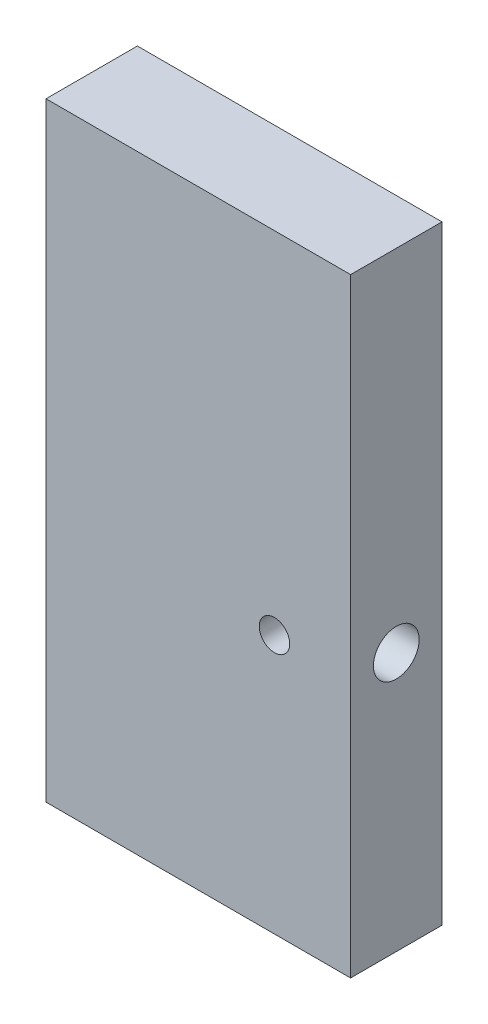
from build123d import *

# Parameters (mm, degrees)
ESQUISSE1_W             = 20
ESQUISSE1_H             = 40
EXTRUSION1_DEPTH        = 6
ESQUISSE2_R             = 1.5
ENL_V_MAT_EXTRU_1_DEPTH = 10
ESQUISSE3_R             = 1
ENL_V_MAT_EXTRU_2_DEPTH = 2


with BuildPart() as part:
    # Esquisse1 → Extrusion1 (new body)
    with BuildSketch(Plane.XY):
        with Locations((-15.168888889, 1.701746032)):
            Rectangle(ESQUISSE1_W, ESQUISSE1_H)
    extrude(amount=EXTRUSION1_DEPTH)

    # Esquisse2 → Enl_v. mat.-Extru.1 (cut)
    with BuildSketch(Plane(origin=(-5.168888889, 0, 0), x_dir=(0, 0, -1), z_dir=(1, 0, 0))):
        with Locations(Location((-3, -1.298253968, 0), (0, 0, 90))):
            Circle(ESQUISSE2_R)
    extrude(amount=-ENL_V_MAT_EXTRU_1_DEPTH, mode=Mode.SUBTRACT)

    # Esquisse3 → Enl_v. mat.-Extru.2 (cut)
    with BuildSketch(Plane.XY.offset(6)):
        with Locations((-10.168888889, -1.298253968)):
            Circle(ESQUISSE3_R)
    extrude(amount=-ENL_V_MAT_EXTRU_2_DEPTH, mode=Mode.SUBTRACT)


solid = part.part
